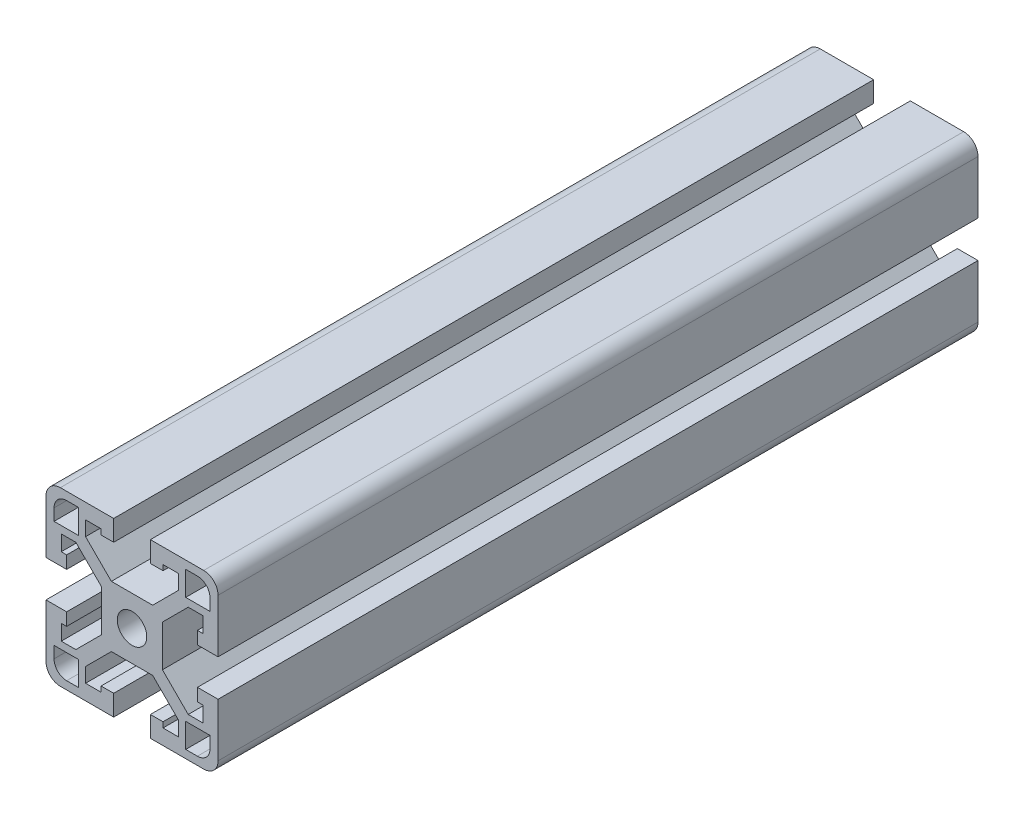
from build123d import *

# Parameters (mm, degrees)
SKETCH1_R           = 3.2639
BOSS_EXTRUDE1_DEPTH = 84.1375


with BuildPart() as part:
    # Sketch1 → Boss-Extrude1 (new, symmetric)
    with BuildSketch(Plane.XY):
        with BuildLine():
            Line((-6.731, 4.575738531), (-6.731, -4.575738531))
            Line((-6.731, -4.575738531), (-12.442261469, -10.287))
            Line((-12.442261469, -10.287), (-15.6718, -10.287))
            Line((-15.6718, -10.287), (-15.6718, -6.858))
            Line((-15.6718, -6.858), (-14.478, -6.858))
            Line((-14.478, -6.858), (-14.478, -4.064))
            Line((-14.478, -4.064), (-19.05, -4.064))
            Line((-19.05, -4.064), (-19.05, -15.875))
            ThreePointArc((-19.05, -15.875), (-18.12006403, -18.12006403), (-15.875, -19.05))
            Line((-15.875, -19.05), (-4.064, -19.05))
            Line((-4.064, -19.05), (-4.064, -14.478))
            Line((-4.064, -14.478), (-6.858, -14.478))
            Line((-6.858, -14.478), (-6.858, -15.6718))
            Line((-6.858, -15.6718), (-10.287, -15.6718))
            Line((-10.287, -15.6718), (-10.287, -12.442261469))
            Line((-10.287, -12.442261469), (-4.575738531, -6.731))
            Line((-4.575738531, -6.731), (4.575738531, -6.731))
            Line((4.575738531, -6.731), (10.287, -12.442261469))
            Line((10.287, -12.442261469), (10.287, -15.6718))
            Line((10.287, -15.6718), (6.858, -15.6718))
            Line((6.858, -15.6718), (6.858, -14.478))
            Line((6.858, -14.478), (4.064, -14.478))
            Line((4.064, -14.478), (4.064, -19.05))
            Line((4.064, -19.05), (15.875, -19.05))
            ThreePointArc((15.875, -19.05), (18.12006403, -18.12006403), (19.05, -15.875))
            Line((19.05, -15.875), (19.05, -4.064))
            Line((19.05, -4.064), (14.478, -4.064))
            Line((14.478, -4.064), (14.478, -6.858))
            Line((14.478, -6.858), (15.6718, -6.858))
            Line((15.6718, -6.858), (15.6718, -10.287))
            Line((15.6718, -10.287), (12.442261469, -10.287))
            Line((12.442261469, -10.287), (6.731, -4.575738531))
            Line((6.731, -4.575738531), (6.731, 4.575738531))
            Line((6.731, 4.575738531), (12.442261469, 10.287))
            Line((12.442261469, 10.287), (15.6718, 10.287))
            Line((15.6718, 10.287), (15.6718, 6.858))
            Line((15.6718, 6.858), (14.478, 6.858))
            Line((14.478, 6.858), (14.478, 4.064))
            Line((14.478, 4.064), (19.05, 4.064))
            Line((19.05, 4.064), (19.05, 15.875))
            ThreePointArc((19.05, 15.875), (18.12006403, 18.12006403), (15.875, 19.05))
            Line((15.875, 19.05), (4.064, 19.05))
            Line((4.064, 19.05), (4.064, 14.478))
            Line((4.064, 14.478), (6.858, 14.478))
            Line((6.858, 14.478), (6.858, 15.6718))
            Line((6.858, 15.6718), (10.287, 15.6718))
            Line((10.287, 15.6718), (10.287, 12.442261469))
            Line((10.287, 12.442261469), (4.575738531, 6.731))
            Line((4.575738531, 6.731), (-4.575738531, 6.731))
            Line((-4.575738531, 6.731), (-10.287, 12.442261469))
            Line((-10.287, 12.442261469), (-10.287, 15.6718))
            Line((-10.287, 15.6718), (-6.858, 15.6718))
            Line((-6.858, 15.6718), (-6.858, 14.478))
            Line((-6.858, 14.478), (-4.064, 14.478))
            Line((-4.064, 14.478), (-4.064, 19.05))
            Line((-4.064, 19.05), (-15.875, 19.05))
            ThreePointArc((-15.875, 19.05), (-18.12006403, 18.12006403), (-19.05, 15.875))
            Line((-19.05, 15.875), (-19.05, 4.064))
            Line((-19.05, 4.064), (-14.478, 4.064))
            Line((-14.478, 4.064), (-14.478, 6.858))
            Line((-14.478, 6.858), (-15.6718, 6.858))
            Line((-15.6718, 6.858), (-15.6718, 10.287))
            Line((-15.6718, 10.287), (-12.442261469, 10.287))
            Line((-12.442261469, 10.287), (-6.731, 4.575738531))
        make_face()
        with Locations(Location((0, 0, 0), (0, 0, 180))):
            Circle(SKETCH1_R, mode=Mode.SUBTRACT)
        with BuildLine():
            Line((-11.8872, 17.272), (-14.478, 17.272))
            ThreePointArc((-14.478, 17.272), (-16.453656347, 16.453656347), (-17.272, 14.478))
            Line((-17.272, 14.478), (-17.272, 11.8872))
            Line((-17.272, 11.8872), (-11.8872, 11.8872))
            Line((-11.8872, 11.8872), (-11.8872, 17.272))
        make_face(mode=Mode.SUBTRACT)
        with BuildLine():
            Line((14.478, 17.272), (11.8872, 17.272))
            Line((11.8872, 17.272), (11.8872, 11.8872))
            Line((11.8872, 11.8872), (17.272, 11.8872))
            Line((17.272, 11.8872), (17.272, 14.478))
            ThreePointArc((17.272, 14.478), (16.453656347, 16.453656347), (14.478, 17.272))
        make_face(mode=Mode.SUBTRACT)
        with BuildLine():
            Line((11.8872, -17.272), (14.478, -17.272))
            ThreePointArc((14.478, -17.272), (16.453656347, -16.453656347), (17.272, -14.478))
            Line((17.272, -14.478), (17.272, -11.8872))
            Line((17.272, -11.8872), (11.8872, -11.8872))
            Line((11.8872, -11.8872), (11.8872, -17.272))
        make_face(mode=Mode.SUBTRACT)
        with BuildLine():
            Line((-14.478, -17.272), (-11.8872, -17.272))
            Line((-11.8872, -17.272), (-11.8872, -11.8872))
            Line((-11.8872, -11.8872), (-17.272, -11.8872))
            Line((-17.272, -11.8872), (-17.272, -14.478))
            ThreePointArc((-17.272, -14.478), (-16.453656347, -16.453656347), (-14.478, -17.272))
        make_face(mode=Mode.SUBTRACT)
    extrude(amount=BOSS_EXTRUDE1_DEPTH, both=True)


solid = part.part
